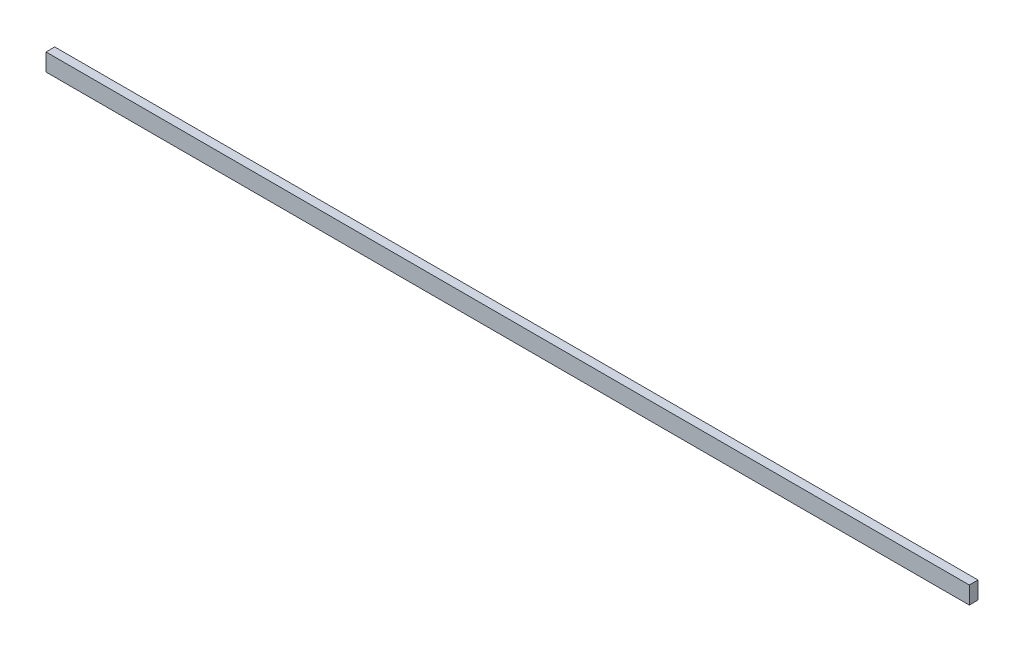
ISO-10303-21;
HEADER;
FILE_DESCRIPTION(('STEP AP214'),'2;1');
FILE_NAME('part.step','',(''),(''),'','','');
FILE_SCHEMA(('AUTOMOTIVE_DESIGN { 1 0 10303 214 1 1 1 1 }'));
ENDSEC;
DATA;
#1=APPLICATION_CONTEXT('core data for automotive mechanical design processes');
#2=APPLICATION_PROTOCOL_DEFINITION('international standard','automotive_design',2000,#1);
#3=PRODUCT_CONTEXT('',#1,'mechanical');
#4=PRODUCT('Part','Part','',(#3));
#5=PRODUCT_RELATED_PRODUCT_CATEGORY('part','',(#4));
#6=PRODUCT_DEFINITION_FORMATION('','',#4);
#7=PRODUCT_DEFINITION_CONTEXT('part definition',#1,'design');
#8=PRODUCT_DEFINITION('design','',#6,#7);
#9=PRODUCT_DEFINITION_SHAPE('','',#8);
#10=(LENGTH_UNIT() NAMED_UNIT(*) SI_UNIT(.MILLI.,.METRE.));
#11=(NAMED_UNIT(*) PLANE_ANGLE_UNIT() SI_UNIT($,.RADIAN.));
#12=(NAMED_UNIT(*) SI_UNIT($,.STERADIAN.) SOLID_ANGLE_UNIT());
#13=UNCERTAINTY_MEASURE_WITH_UNIT(LENGTH_MEASURE(1.E-05),#10,'distance_accuracy_value','');
#14=(GEOMETRIC_REPRESENTATION_CONTEXT(3) GLOBAL_UNCERTAINTY_ASSIGNED_CONTEXT((#13)) GLOBAL_UNIT_ASSIGNED_CONTEXT((#10,
#11,#12)) REPRESENTATION_CONTEXT('',''));
#15=CARTESIAN_POINT('',(0.,0.,0.));
#16=DIRECTION('',(0.,0.,1.));
#17=DIRECTION('',(1.,0.,0.));
#18=AXIS2_PLACEMENT_3D('',#15,#16,#17);
#19=CARTESIAN_POINT('',(530.,0.,0.));
#20=DIRECTION('',(0.,0.,-1.));
#21=DIRECTION('',(-1.,0.,0.));
#22=AXIS2_PLACEMENT_3D('',#19,#20,#21);
#23=PLANE('',#22);
#24=DIRECTION('',(0.,-1.,0.));
#25=VECTOR('',#24,1.);
#26=CARTESIAN_POINT('',(0.,0.,0.));
#27=LINE('',#26,#25);
#28=CARTESIAN_POINT('',(0.,10.,0.));
#29=VERTEX_POINT('',#28);
#30=CARTESIAN_POINT('',(0.,0.,0.));
#31=VERTEX_POINT('',#30);
#32=EDGE_CURVE('E70',#29,#31,#27,.T.);
#33=ORIENTED_EDGE('',*,*,#32,.T.);
#34=DIRECTION('',(-1.,0.,0.));
#35=VECTOR('',#34,1.);
#36=CARTESIAN_POINT('',(530.,0.,0.));
#37=LINE('',#36,#35);
#38=CARTESIAN_POINT('',(530.,0.,0.));
#39=VERTEX_POINT('',#38);
#40=EDGE_CURVE('E11',#39,#31,#37,.T.);
#41=ORIENTED_EDGE('',*,*,#40,.F.);
#42=DIRECTION('',(0.,-1.,0.));
#43=VECTOR('',#42,1.);
#44=CARTESIAN_POINT('',(530.,0.,0.));
#45=LINE('',#44,#43);
#46=CARTESIAN_POINT('',(530.,10.,0.));
#47=VERTEX_POINT('',#46);
#48=EDGE_CURVE('E88',#47,#39,#45,.T.);
#49=ORIENTED_EDGE('',*,*,#48,.F.);
#50=DIRECTION('',(-1.,0.,0.));
#51=VECTOR('',#50,1.);
#52=CARTESIAN_POINT('',(530.,10.,0.));
#53=LINE('',#52,#51);
#54=EDGE_CURVE('E82',#47,#29,#53,.T.);
#55=ORIENTED_EDGE('',*,*,#54,.T.);
#56=EDGE_LOOP('',(#33,#41,#49,#55));
#57=FACE_BOUND('',#56,.T.);
#58=ADVANCED_FACE('F26',(#57),#23,.F.);
#59=CARTESIAN_POINT('',(530.,0.,0.));
#60=DIRECTION('',(0.,1.,0.));
#61=DIRECTION('',(0.,0.,1.));
#62=AXIS2_PLACEMENT_3D('',#59,#60,#61);
#63=PLANE('',#62);
#64=DIRECTION('',(0.,0.,-1.));
#65=VECTOR('',#64,1.);
#66=CARTESIAN_POINT('',(0.,0.,0.));
#67=LINE('',#66,#65);
#68=CARTESIAN_POINT('',(0.,0.,-5.));
#69=VERTEX_POINT('',#68);
#70=EDGE_CURVE('E66',#31,#69,#67,.T.);
#71=ORIENTED_EDGE('',*,*,#70,.T.);
#72=DIRECTION('',(-1.,0.,0.));
#73=VECTOR('',#72,1.);
#74=CARTESIAN_POINT('',(530.,0.,-5.));
#75=LINE('',#74,#73);
#76=CARTESIAN_POINT('',(530.,0.,-5.));
#77=VERTEX_POINT('',#76);
#78=EDGE_CURVE('E33',#77,#69,#75,.T.);
#79=ORIENTED_EDGE('',*,*,#78,.F.);
#80=DIRECTION('',(0.,0.,-1.));
#81=VECTOR('',#80,1.);
#82=CARTESIAN_POINT('',(530.,0.,0.));
#83=LINE('',#82,#81);
#84=EDGE_CURVE('E78',#39,#77,#83,.T.);
#85=ORIENTED_EDGE('',*,*,#84,.F.);
#86=ORIENTED_EDGE('',*,*,#40,.T.);
#87=EDGE_LOOP('',(#71,#79,#85,#86));
#88=FACE_BOUND('',#87,.T.);
#89=ADVANCED_FACE('F77',(#88),#63,.F.);
#90=CARTESIAN_POINT('',(530.,0.,-5.));
#91=DIRECTION('',(0.,0.,1.));
#92=DIRECTION('',(1.,0.,0.));
#93=AXIS2_PLACEMENT_3D('',#90,#91,#92);
#94=PLANE('',#93);
#95=DIRECTION('',(0.,1.,0.));
#96=VECTOR('',#95,1.);
#97=CARTESIAN_POINT('',(0.,0.,-5.));
#98=LINE('',#97,#96);
#99=CARTESIAN_POINT('',(0.,10.,-5.));
#100=VERTEX_POINT('',#99);
#101=EDGE_CURVE('E71',#69,#100,#98,.T.);
#102=ORIENTED_EDGE('',*,*,#101,.T.);
#103=DIRECTION('',(-1.,0.,0.));
#104=VECTOR('',#103,1.);
#105=CARTESIAN_POINT('',(530.,10.,-5.));
#106=LINE('',#105,#104);
#107=CARTESIAN_POINT('',(530.,10.,-5.));
#108=VERTEX_POINT('',#107);
#109=EDGE_CURVE('E94',#108,#100,#106,.T.);
#110=ORIENTED_EDGE('',*,*,#109,.F.);
#111=DIRECTION('',(0.,1.,0.));
#112=VECTOR('',#111,1.);
#113=CARTESIAN_POINT('',(530.,0.,-5.));
#114=LINE('',#113,#112);
#115=EDGE_CURVE('E45',#77,#108,#114,.T.);
#116=ORIENTED_EDGE('',*,*,#115,.F.);
#117=ORIENTED_EDGE('',*,*,#78,.T.);
#118=EDGE_LOOP('',(#102,#110,#116,#117));
#119=FACE_BOUND('',#118,.T.);
#120=ADVANCED_FACE('F97',(#119),#94,.F.);
#121=CARTESIAN_POINT('',(530.,10.,0.));
#122=DIRECTION('',(0.,-1.,0.));
#123=DIRECTION('',(0.,0.,-1.));
#124=AXIS2_PLACEMENT_3D('',#121,#122,#123);
#125=PLANE('',#124);
#126=DIRECTION('',(0.,0.,1.));
#127=VECTOR('',#126,1.);
#128=CARTESIAN_POINT('',(0.,10.,0.));
#129=LINE('',#128,#127);
#130=EDGE_CURVE('E86',#100,#29,#129,.T.);
#131=ORIENTED_EDGE('',*,*,#130,.T.);
#132=ORIENTED_EDGE('',*,*,#54,.F.);
#133=DIRECTION('',(0.,0.,1.));
#134=VECTOR('',#133,1.);
#135=CARTESIAN_POINT('',(530.,10.,0.));
#136=LINE('',#135,#134);
#137=EDGE_CURVE('E40',#108,#47,#136,.T.);
#138=ORIENTED_EDGE('',*,*,#137,.F.);
#139=ORIENTED_EDGE('',*,*,#109,.T.);
#140=EDGE_LOOP('',(#131,#132,#138,#139));
#141=FACE_BOUND('',#140,.T.);
#142=ADVANCED_FACE('F99',(#141),#125,.F.);
#143=CARTESIAN_POINT('',(530.,10.,0.));
#144=DIRECTION('',(-1.,0.,0.));
#145=DIRECTION('',(0.,0.,1.));
#146=AXIS2_PLACEMENT_3D('',#143,#144,#145);
#147=PLANE('',#146);
#148=ORIENTED_EDGE('',*,*,#48,.T.);
#149=ORIENTED_EDGE('',*,*,#84,.T.);
#150=ORIENTED_EDGE('',*,*,#115,.T.);
#151=ORIENTED_EDGE('',*,*,#137,.T.);
#152=EDGE_LOOP('',(#148,#149,#150,#151));
#153=FACE_BOUND('',#152,.T.);
#154=ADVANCED_FACE('F100',(#153),#147,.F.);
#155=CARTESIAN_POINT('',(0.,10.,0.));
#156=DIRECTION('',(-1.,0.,0.));
#157=DIRECTION('',(0.,0.,1.));
#158=AXIS2_PLACEMENT_3D('',#155,#156,#157);
#159=PLANE('',#158);
#160=ORIENTED_EDGE('',*,*,#32,.F.);
#161=ORIENTED_EDGE('',*,*,#130,.F.);
#162=ORIENTED_EDGE('',*,*,#101,.F.);
#163=ORIENTED_EDGE('',*,*,#70,.F.);
#164=EDGE_LOOP('',(#160,#161,#162,#163));
#165=FACE_BOUND('',#164,.T.);
#166=ADVANCED_FACE('F67',(#165),#159,.T.);
#167=CLOSED_SHELL('',(#58,#89,#120,#142,#154,#166));
#168=MANIFOLD_SOLID_BREP('B2',#167);
#169=ADVANCED_BREP_SHAPE_REPRESENTATION('',(#18,#168),#14);
#170=SHAPE_DEFINITION_REPRESENTATION(#9,#169);
ENDSEC;
END-ISO-10303-21;
